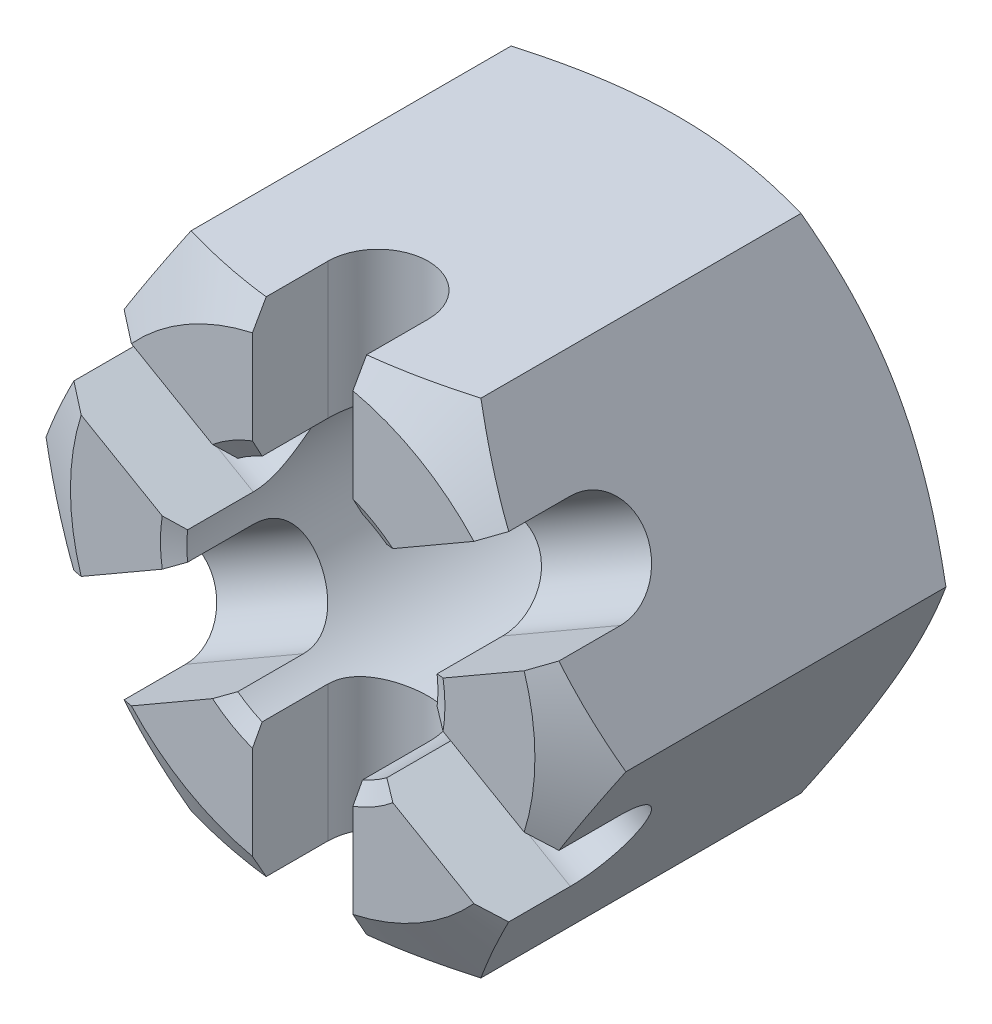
from build123d import *
from OCP.BRepFilletAPI import BRepFilletAPI_MakeChamfer

# Parameters (mm, degrees)
SKETCH1_R         = 2.5
BASENUT_DEPTH     = 7.7
ENDCHAMFER_SIZE   = 0.333333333
ENDCHAMFER_SIZE2  = 0.19245009
SLOT_DEPTH        = 11.845429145
SLOTPATTERN_COUNT = 3


with BuildPart() as part:
    # Sketch1 → BaseNut (new body)
    with BuildSketch(Plane.XY):
        Polygon((2.886751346, -5), (5.773502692, 0), (2.886751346, 5), (-2.886751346, 5), (-5.773502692, 0), (-2.886751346, -5), align=None)
        Circle(SKETCH1_R, mode=Mode.SUBTRACT)
    extrude(amount=-BASENUT_DEPTH)

    # Sketch2 → Double-Chamfer (revolve, cut)
    with BuildSketch(Plane(origin=(0, 0, 0), x_dir=(1, 0, 0), z_dir=(0, 1, 0))):
        Polygon((-5.773502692, 7.7), (-4.625, 7.7), (-5.773502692, 7.036911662), align=None)
        Polygon((-5.773502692, 0.663088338), (-5.773502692, 0), (-4.625, 0), align=None)
    revolve(axis=Axis((0, 0, -3.375940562), (0, 0, 1)), mode=Mode.SUBTRACT)

    # EndChamfer: one chamfer whose edges measure the first distance from different faces: ONE call of the kernel's chamfer builder (chamfer() names one face for all edges)
    endchamfer_edges_1 = [part.edges().sort_by_distance(p)[0] for p in [
        (-2.5, 0, -7.7),
    ]]
    endchamfer_side_1 = [part.faces().sort_by_distance(p)[0] for p in [
        (-2.5, 0, -3.85),
    ]]
    endchamfer_edges_2 = [part.edges().sort_by_distance(p)[0] for p in [
        (-2.5, 0, 0),
    ]]
    endchamfer_side_2 = [part.faces().sort_by_distance(p)[0] for p in [
        (4.494185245, 0, 0),
    ]]
    endchamfer = BRepFilletAPI_MakeChamfer(part.part.solid().wrapped)
    for e in endchamfer_edges_1:
        endchamfer.Add(ENDCHAMFER_SIZE, ENDCHAMFER_SIZE2, e.wrapped, endchamfer_side_1[0].wrapped)  # the first distance lies on this face
    for e in endchamfer_edges_2:
        endchamfer.Add(ENDCHAMFER_SIZE, ENDCHAMFER_SIZE2, e.wrapped, endchamfer_side_2[0].wrapped)  # the first distance lies on this face
    add(Compound.cast(endchamfer.Shape()), mode=Mode.REPLACE)

    # Sketch3 → Slot (cut, symmetric)
    with BuildSketch(Plane(origin=(0, 0, 0), x_dir=(1, 0, 0), z_dir=(0, 1, 0))):
        with BuildLine():
            Line((-1, -30.510518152), (-1, 0))
            Line((-1, 0), (-1, 1.5))
            ThreePointArc((-1, 1.5), (0, 2.5), (1, 1.5))
            Line((1, 1.5), (1, 0))
            Line((1, 0), (1, -30.510518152))
            Line((1, -30.510518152), (1, -91.531554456))
            Line((1, -91.531554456), (-1, -91.531554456))
            Line((-1, -91.531554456), (-1, -30.510518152))
        make_face()
    slot = extrude(amount=SLOT_DEPTH, both=True, mode=Mode.SUBTRACT)

    # SlotPattern: Slot ×3 about axis
    slotpattern_axis = Axis((0, 0, -3.375940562), (0, 0, 1))
    for i in range(1, SLOTPATTERN_COUNT):
        add(slot.rotate(slotpattern_axis, i * 360 / SLOTPATTERN_COUNT), mode=Mode.SUBTRACT)


solid = part.part
